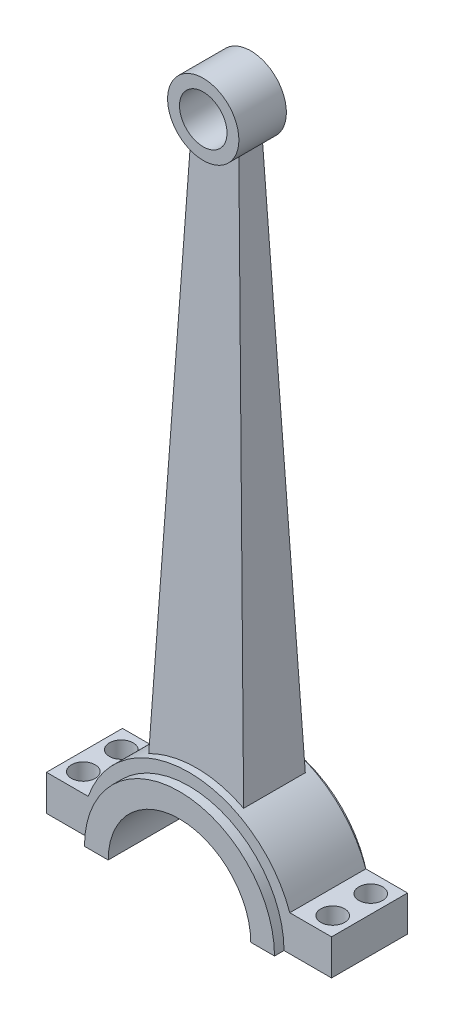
ISO-10303-21;
HEADER;
FILE_DESCRIPTION(('STEP AP214'),'2;1');
FILE_NAME('part.step','',(''),(''),'','','');
FILE_SCHEMA(('AUTOMOTIVE_DESIGN { 1 0 10303 214 1 1 1 1 }'));
ENDSEC;
DATA;
#1=APPLICATION_CONTEXT('core data for automotive mechanical design processes');
#2=APPLICATION_PROTOCOL_DEFINITION('international standard','automotive_design',2000,#1);
#3=PRODUCT_CONTEXT('',#1,'mechanical');
#4=PRODUCT('Part','Part','',(#3));
#5=PRODUCT_RELATED_PRODUCT_CATEGORY('part','',(#4));
#6=PRODUCT_DEFINITION_FORMATION('','',#4);
#7=PRODUCT_DEFINITION_CONTEXT('part definition',#1,'design');
#8=PRODUCT_DEFINITION('design','',#6,#7);
#9=PRODUCT_DEFINITION_SHAPE('','',#8);
#10=(LENGTH_UNIT() NAMED_UNIT(*) SI_UNIT(.MILLI.,.METRE.));
#11=(NAMED_UNIT(*) PLANE_ANGLE_UNIT() SI_UNIT($,.RADIAN.));
#12=(NAMED_UNIT(*) SI_UNIT($,.STERADIAN.) SOLID_ANGLE_UNIT());
#13=UNCERTAINTY_MEASURE_WITH_UNIT(LENGTH_MEASURE(1.E-05),#10,'distance_accuracy_value','');
#14=(GEOMETRIC_REPRESENTATION_CONTEXT(3) GLOBAL_UNCERTAINTY_ASSIGNED_CONTEXT((#13)) GLOBAL_UNIT_ASSIGNED_CONTEXT((#10,
#11,#12)) REPRESENTATION_CONTEXT('',''));
#15=CARTESIAN_POINT('',(0.,0.,0.));
#16=DIRECTION('',(0.,0.,1.));
#17=DIRECTION('',(1.,0.,0.));
#18=AXIS2_PLACEMENT_3D('',#15,#16,#17);
#19=CARTESIAN_POINT('',(0.,0.,16.));
#20=DIRECTION('',(0.,0.,1.));
#21=DIRECTION('',(1.,0.,0.));
#22=AXIS2_PLACEMENT_3D('',#19,#20,#21);
#23=PLANE('',#22);
#24=DIRECTION('',(1.,0.,0.));
#25=VECTOR('',#24,1.);
#26=CARTESIAN_POINT('',(0.,0.,16.));
#27=LINE('',#26,#25);
#28=CARTESIAN_POINT('',(-60.,0.,16.));
#29=VERTEX_POINT('',#28);
#30=CARTESIAN_POINT('',(-40.,0.,16.));
#31=VERTEX_POINT('',#30);
#32=EDGE_CURVE('E50',#29,#31,#27,.T.);
#33=ORIENTED_EDGE('',*,*,#32,.T.);
#34=CARTESIAN_POINT('',(0.,0.,16.));
#35=DIRECTION('',(0.,0.,1.));
#36=DIRECTION('',(1.,0.,0.));
#37=AXIS2_PLACEMENT_3D('',#34,#35,#36);
#38=CIRCLE('',#37,40.);
#39=CARTESIAN_POINT('',(40.,0.,16.));
#40=VERTEX_POINT('',#39);
#41=EDGE_CURVE('E54',#31,#40,#38,.F.);
#42=ORIENTED_EDGE('',*,*,#41,.T.);
#43=DIRECTION('',(1.,0.,0.));
#44=VECTOR('',#43,1.);
#45=CARTESIAN_POINT('',(0.,0.,16.));
#46=LINE('',#45,#44);
#47=CARTESIAN_POINT('',(60.,0.,16.));
#48=VERTEX_POINT('',#47);
#49=EDGE_CURVE('E240',#40,#48,#46,.T.);
#50=ORIENTED_EDGE('',*,*,#49,.T.);
#51=DIRECTION('',(0.,1.,0.));
#52=VECTOR('',#51,1.);
#53=CARTESIAN_POINT('',(60.,0.,16.));
#54=LINE('',#53,#52);
#55=CARTESIAN_POINT('',(60.,15.,16.));
#56=VERTEX_POINT('',#55);
#57=EDGE_CURVE('E242',#48,#56,#54,.T.);
#58=ORIENTED_EDGE('',*,*,#57,.T.);
#59=DIRECTION('',(1.,0.,0.));
#60=VECTOR('',#59,1.);
#61=CARTESIAN_POINT('',(0.,15.,16.));
#62=LINE('',#61,#60);
#63=CARTESIAN_POINT('',(42.4264068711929,15.,16.));
#64=VERTEX_POINT('',#63);
#65=EDGE_CURVE('E245',#64,#56,#62,.T.);
#66=ORIENTED_EDGE('',*,*,#65,.F.);
#67=CARTESIAN_POINT('',(0.,0.,16.));
#68=DIRECTION('',(0.,0.,1.));
#69=DIRECTION('',(1.,0.,0.));
#70=AXIS2_PLACEMENT_3D('',#67,#68,#69);
#71=CIRCLE('',#70,45.);
#72=CARTESIAN_POINT('',(-42.4264068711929,15.,16.));
#73=VERTEX_POINT('',#72);
#74=EDGE_CURVE('E248',#64,#73,#71,.T.);
#75=ORIENTED_EDGE('',*,*,#74,.T.);
#76=DIRECTION('',(1.,0.,0.));
#77=VECTOR('',#76,1.);
#78=CARTESIAN_POINT('',(0.,15.,16.));
#79=LINE('',#78,#77);
#80=CARTESIAN_POINT('',(-60.,15.,16.));
#81=VERTEX_POINT('',#80);
#82=EDGE_CURVE('E250',#81,#73,#79,.T.);
#83=ORIENTED_EDGE('',*,*,#82,.F.);
#84=DIRECTION('',(0.,1.,0.));
#85=VECTOR('',#84,1.);
#86=CARTESIAN_POINT('',(-60.,0.,16.));
#87=LINE('',#86,#85);
#88=EDGE_CURVE('E253',#29,#81,#87,.T.);
#89=ORIENTED_EDGE('',*,*,#88,.F.);
#90=EDGE_LOOP('',(#33,#42,#50,#58,#66,#75,#83,#89));
#91=FACE_BOUND('',#90,.T.);
#92=ADVANCED_FACE('F35',(#91),#23,.T.);
#93=CARTESIAN_POINT('',(0.,0.,-16.));
#94=DIRECTION('',(0.,0.,1.));
#95=DIRECTION('',(1.,0.,0.));
#96=AXIS2_PLACEMENT_3D('',#93,#94,#95);
#97=PLANE('',#96);
#98=CARTESIAN_POINT('',(0.,0.,-16.));
#99=DIRECTION('',(0.,0.,1.));
#100=DIRECTION('',(1.,0.,0.));
#101=AXIS2_PLACEMENT_3D('',#98,#99,#100);
#102=CIRCLE('',#101,40.);
#103=CARTESIAN_POINT('',(-40.,0.,-16.));
#104=VERTEX_POINT('',#103);
#105=CARTESIAN_POINT('',(40.,0.,-16.));
#106=VERTEX_POINT('',#105);
#107=EDGE_CURVE('E11',#104,#106,#102,.F.);
#108=ORIENTED_EDGE('',*,*,#107,.F.);
#109=DIRECTION('',(1.,0.,0.));
#110=VECTOR('',#109,1.);
#111=CARTESIAN_POINT('',(0.,0.,-16.));
#112=LINE('',#111,#110);
#113=CARTESIAN_POINT('',(-60.,0.,-16.));
#114=VERTEX_POINT('',#113);
#115=EDGE_CURVE('E243',#114,#104,#112,.T.);
#116=ORIENTED_EDGE('',*,*,#115,.F.);
#117=DIRECTION('',(0.,1.,0.));
#118=VECTOR('',#117,1.);
#119=CARTESIAN_POINT('',(-60.,0.,-16.));
#120=LINE('',#119,#118);
#121=CARTESIAN_POINT('',(-60.,15.,-16.));
#122=VERTEX_POINT('',#121);
#123=EDGE_CURVE('E271',#114,#122,#120,.T.);
#124=ORIENTED_EDGE('',*,*,#123,.T.);
#125=DIRECTION('',(1.,0.,0.));
#126=VECTOR('',#125,1.);
#127=CARTESIAN_POINT('',(0.,15.,-16.));
#128=LINE('',#127,#126);
#129=CARTESIAN_POINT('',(-42.4264068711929,15.,-16.));
#130=VERTEX_POINT('',#129);
#131=EDGE_CURVE('E268',#122,#130,#128,.T.);
#132=ORIENTED_EDGE('',*,*,#131,.T.);
#133=CARTESIAN_POINT('',(0.,0.,-16.));
#134=DIRECTION('',(0.,0.,1.));
#135=DIRECTION('',(1.,0.,0.));
#136=AXIS2_PLACEMENT_3D('',#133,#134,#135);
#137=CIRCLE('',#136,45.);
#138=CARTESIAN_POINT('',(42.4264068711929,15.,-16.));
#139=VERTEX_POINT('',#138);
#140=EDGE_CURVE('E265',#139,#130,#137,.T.);
#141=ORIENTED_EDGE('',*,*,#140,.F.);
#142=DIRECTION('',(1.,0.,0.));
#143=VECTOR('',#142,1.);
#144=CARTESIAN_POINT('',(0.,15.,-16.));
#145=LINE('',#144,#143);
#146=CARTESIAN_POINT('',(60.,15.,-16.));
#147=VERTEX_POINT('',#146);
#148=EDGE_CURVE('E262',#139,#147,#145,.T.);
#149=ORIENTED_EDGE('',*,*,#148,.T.);
#150=DIRECTION('',(0.,1.,0.));
#151=VECTOR('',#150,1.);
#152=CARTESIAN_POINT('',(60.,0.,-16.));
#153=LINE('',#152,#151);
#154=CARTESIAN_POINT('',(60.,0.,-16.));
#155=VERTEX_POINT('',#154);
#156=EDGE_CURVE('E259',#155,#147,#153,.T.);
#157=ORIENTED_EDGE('',*,*,#156,.F.);
#158=DIRECTION('',(1.,0.,0.));
#159=VECTOR('',#158,1.);
#160=CARTESIAN_POINT('',(0.,0.,-16.));
#161=LINE('',#160,#159);
#162=EDGE_CURVE('E239',#106,#155,#161,.T.);
#163=ORIENTED_EDGE('',*,*,#162,.F.);
#164=EDGE_LOOP('',(#108,#116,#124,#132,#141,#149,#157,#163));
#165=FACE_BOUND('',#164,.T.);
#166=ADVANCED_FACE('F338',(#165),#97,.F.);
#167=CARTESIAN_POINT('',(0.,0.,16.));
#168=DIRECTION('',(0.,0.,-1.));
#169=DIRECTION('',(-1.,0.,0.));
#170=AXIS2_PLACEMENT_3D('',#167,#168,#169);
#171=CYLINDRICAL_SURFACE('',#170,30.);
#172=DIRECTION('',(0.,0.,-1.));
#173=VECTOR('',#172,1.);
#174=CARTESIAN_POINT('',(-30.,0.,16.));
#175=LINE('',#174,#173);
#176=CARTESIAN_POINT('',(-30.,0.,20.));
#177=VERTEX_POINT('',#176);
#178=CARTESIAN_POINT('',(-30.,0.,-20.));
#179=VERTEX_POINT('',#178);
#180=EDGE_CURVE('E257',#177,#179,#175,.T.);
#181=ORIENTED_EDGE('',*,*,#180,.T.);
#182=CARTESIAN_POINT('',(0.,0.,-20.));
#183=DIRECTION('',(0.,0.,-1.));
#184=DIRECTION('',(1.,0.,0.));
#185=AXIS2_PLACEMENT_3D('',#182,#183,#184);
#186=CIRCLE('',#185,30.);
#187=CARTESIAN_POINT('',(30.,0.,-20.));
#188=VERTEX_POINT('',#187);
#189=EDGE_CURVE('E151',#179,#188,#186,.T.);
#190=ORIENTED_EDGE('',*,*,#189,.T.);
#191=DIRECTION('',(0.,0.,-1.));
#192=VECTOR('',#191,1.);
#193=CARTESIAN_POINT('',(30.,0.,16.));
#194=LINE('',#193,#192);
#195=CARTESIAN_POINT('',(30.,0.,20.));
#196=VERTEX_POINT('',#195);
#197=EDGE_CURVE('E43',#196,#188,#194,.T.);
#198=ORIENTED_EDGE('',*,*,#197,.F.);
#199=CARTESIAN_POINT('',(0.,0.,20.));
#200=DIRECTION('',(0.,0.,-1.));
#201=DIRECTION('',(1.,0.,0.));
#202=AXIS2_PLACEMENT_3D('',#199,#200,#201);
#203=CIRCLE('',#202,30.);
#204=EDGE_CURVE('E149',#177,#196,#203,.T.);
#205=ORIENTED_EDGE('',*,*,#204,.F.);
#206=EDGE_LOOP('',(#181,#190,#198,#205));
#207=FACE_BOUND('',#206,.T.);
#208=ADVANCED_FACE('F147',(#207),#171,.F.);
#209=CARTESIAN_POINT('',(0.,0.,16.));
#210=DIRECTION('',(0.,1.,0.));
#211=DIRECTION('',(0.,0.,1.));
#212=AXIS2_PLACEMENT_3D('',#209,#210,#211);
#213=PLANE('',#212);
#214=ORIENTED_EDGE('',*,*,#197,.T.);
#215=DIRECTION('',(1.,0.,0.));
#216=VECTOR('',#215,1.);
#217=CARTESIAN_POINT('',(30.,0.,-20.));
#218=LINE('',#217,#216);
#219=CARTESIAN_POINT('',(40.,0.,-20.));
#220=VERTEX_POINT('',#219);
#221=EDGE_CURVE('E181',#188,#220,#218,.T.);
#222=ORIENTED_EDGE('',*,*,#221,.T.);
#223=DIRECTION('',(0.,0.,-1.));
#224=VECTOR('',#223,1.);
#225=CARTESIAN_POINT('',(40.,0.,20.));
#226=LINE('',#225,#224);
#227=EDGE_CURVE('E188',#106,#220,#226,.T.);
#228=ORIENTED_EDGE('',*,*,#227,.F.);
#229=ORIENTED_EDGE('',*,*,#162,.T.);
#230=DIRECTION('',(0.,0.,-1.));
#231=VECTOR('',#230,1.);
#232=CARTESIAN_POINT('',(60.,0.,16.));
#233=LINE('',#232,#231);
#234=EDGE_CURVE('E155',#48,#155,#233,.T.);
#235=ORIENTED_EDGE('',*,*,#234,.F.);
#236=ORIENTED_EDGE('',*,*,#49,.F.);
#237=CARTESIAN_POINT('',(40.,0.,20.));
#238=VERTEX_POINT('',#237);
#239=EDGE_CURVE('E162',#238,#40,#226,.T.);
#240=ORIENTED_EDGE('',*,*,#239,.F.);
#241=DIRECTION('',(1.,0.,0.));
#242=VECTOR('',#241,1.);
#243=CARTESIAN_POINT('',(30.,0.,20.));
#244=LINE('',#243,#242);
#245=EDGE_CURVE('E158',#196,#238,#244,.T.);
#246=ORIENTED_EDGE('',*,*,#245,.F.);
#247=EDGE_LOOP('',(#214,#222,#228,#229,#235,#236,#240,#246));
#248=FACE_BOUND('',#247,.T.);
#249=CARTESIAN_POINT('',(52.5,0.,-8.00000000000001));
#250=DIRECTION('',(0.,1.,0.));
#251=DIRECTION('',(0.,0.,-1.));
#252=AXIS2_PLACEMENT_3D('',#249,#250,#251);
#253=CIRCLE('',#252,5.);
#254=CARTESIAN_POINT('',(52.5,0.,-13.));
#255=VERTEX_POINT('',#254);
#256=EDGE_CURVE('E191',#255,#255,#253,.T.);
#257=ORIENTED_EDGE('',*,*,#256,.T.);
#258=EDGE_LOOP('',(#257));
#259=FACE_BOUND('',#258,.T.);
#260=CARTESIAN_POINT('',(52.5,0.,7.99999999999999));
#261=DIRECTION('',(0.,1.,0.));
#262=DIRECTION('',(0.,0.,-1.));
#263=AXIS2_PLACEMENT_3D('',#260,#261,#262);
#264=CIRCLE('',#263,5.);
#265=CARTESIAN_POINT('',(52.5,0.,3.));
#266=VERTEX_POINT('',#265);
#267=EDGE_CURVE('E192',#266,#266,#264,.T.);
#268=ORIENTED_EDGE('',*,*,#267,.T.);
#269=EDGE_LOOP('',(#268));
#270=FACE_BOUND('',#269,.T.);
#271=ADVANCED_FACE('F159',(#248,#259,#270),#213,.F.);
#272=CARTESIAN_POINT('',(60.,0.,16.));
#273=DIRECTION('',(-1.,0.,0.));
#274=DIRECTION('',(0.,0.,1.));
#275=AXIS2_PLACEMENT_3D('',#272,#273,#274);
#276=PLANE('',#275);
#277=ORIENTED_EDGE('',*,*,#156,.T.);
#278=DIRECTION('',(0.,0.,-1.));
#279=VECTOR('',#278,1.);
#280=CARTESIAN_POINT('',(60.,15.,16.));
#281=LINE('',#280,#279);
#282=EDGE_CURVE('E285',#56,#147,#281,.T.);
#283=ORIENTED_EDGE('',*,*,#282,.F.);
#284=ORIENTED_EDGE('',*,*,#57,.F.);
#285=ORIENTED_EDGE('',*,*,#234,.T.);
#286=EDGE_LOOP('',(#277,#283,#284,#285));
#287=FACE_BOUND('',#286,.T.);
#288=ADVANCED_FACE('F362',(#287),#276,.F.);
#289=CARTESIAN_POINT('',(0.,15.,16.));
#290=DIRECTION('',(0.,1.,0.));
#291=DIRECTION('',(0.,0.,1.));
#292=AXIS2_PLACEMENT_3D('',#289,#290,#291);
#293=PLANE('',#292);
#294=CARTESIAN_POINT('',(52.5,15.,7.99999999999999));
#295=DIRECTION('',(0.,1.,0.));
#296=DIRECTION('',(0.,0.,1.));
#297=AXIS2_PLACEMENT_3D('',#294,#295,#296);
#298=CIRCLE('',#297,5.);
#299=CARTESIAN_POINT('',(52.5,15.,13.));
#300=VERTEX_POINT('',#299);
#301=EDGE_CURVE('E195',#300,#300,#298,.T.);
#302=ORIENTED_EDGE('',*,*,#301,.F.);
#303=EDGE_LOOP('',(#302));
#304=FACE_BOUND('',#303,.T.);
#305=CARTESIAN_POINT('',(52.5,15.,-8.00000000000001));
#306=DIRECTION('',(0.,1.,0.));
#307=DIRECTION('',(0.,0.,1.));
#308=AXIS2_PLACEMENT_3D('',#305,#306,#307);
#309=CIRCLE('',#308,5.);
#310=CARTESIAN_POINT('',(52.5,15.,-3.00000000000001));
#311=VERTEX_POINT('',#310);
#312=EDGE_CURVE('E196',#311,#311,#309,.T.);
#313=ORIENTED_EDGE('',*,*,#312,.F.);
#314=EDGE_LOOP('',(#313));
#315=FACE_BOUND('',#314,.T.);
#316=ORIENTED_EDGE('',*,*,#148,.F.);
#317=DIRECTION('',(0.,0.,-1.));
#318=VECTOR('',#317,1.);
#319=CARTESIAN_POINT('',(42.4264068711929,15.,16.));
#320=LINE('',#319,#318);
#321=EDGE_CURVE('E283',#64,#139,#320,.T.);
#322=ORIENTED_EDGE('',*,*,#321,.F.);
#323=ORIENTED_EDGE('',*,*,#65,.T.);
#324=ORIENTED_EDGE('',*,*,#282,.T.);
#325=EDGE_LOOP('',(#316,#322,#323,#324));
#326=FACE_BOUND('',#325,.T.);
#327=ADVANCED_FACE('F359',(#304,#315,#326),#293,.T.);
#328=CARTESIAN_POINT('',(0.,0.,16.));
#329=DIRECTION('',(0.,0.,-1.));
#330=DIRECTION('',(-1.,0.,0.));
#331=AXIS2_PLACEMENT_3D('',#328,#329,#330);
#332=CYLINDRICAL_SURFACE('',#331,45.);
#333=DIRECTION('',(0.,0.,-1.));
#334=VECTOR('',#333,1.);
#335=CARTESIAN_POINT('',(19.9763796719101,40.3229990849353,5.));
#336=LINE('',#335,#334);
#337=CARTESIAN_POINT('',(19.9763796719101,40.3229990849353,12.9792792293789));
#338=VERTEX_POINT('',#337);
#339=CARTESIAN_POINT('',(19.9763796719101,40.3229990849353,-12.9792792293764));
#340=VERTEX_POINT('',#339);
#341=EDGE_CURVE('E236',#338,#340,#336,.T.);
#342=ORIENTED_EDGE('',*,*,#341,.F.);
#343=CARTESIAN_POINT('',(0.,0.,14.3873893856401));
#344=DIRECTION('',(0.,0.0348994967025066,0.999390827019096));
#345=DIRECTION('',(0.,0.999390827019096,-0.0348994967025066));
#346=AXIS2_PLACEMENT_3D('',#343,#344,#345);
#347=ELLIPSE('',#346,45.027429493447,45.);
#348=CARTESIAN_POINT('',(-19.9763796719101,40.3229990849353,12.9792792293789));
#349=VERTEX_POINT('',#348);
#350=EDGE_CURVE('E300',#338,#349,#347,.T.);
#351=ORIENTED_EDGE('',*,*,#350,.T.);
#352=DIRECTION('',(0.,0.,-1.));
#353=VECTOR('',#352,1.);
#354=CARTESIAN_POINT('',(-19.9763796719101,40.3229990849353,5.));
#355=LINE('',#354,#353);
#356=CARTESIAN_POINT('',(-19.9763796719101,40.3229990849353,-12.9792792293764));
#357=VERTEX_POINT('',#356);
#358=EDGE_CURVE('E228',#349,#357,#355,.T.);
#359=ORIENTED_EDGE('',*,*,#358,.T.);
#360=CARTESIAN_POINT('',(0.,0.,-14.3873893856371));
#361=DIRECTION('',(0.,0.0348994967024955,-0.999390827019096));
#362=DIRECTION('',(0.,-0.999390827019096,-0.0348994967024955));
#363=AXIS2_PLACEMENT_3D('',#360,#361,#362);
#364=ELLIPSE('',#363,45.027429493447,45.);
#365=EDGE_CURVE('E223',#340,#357,#364,.F.);
#366=ORIENTED_EDGE('',*,*,#365,.F.);
#367=EDGE_LOOP('',(#342,#351,#359,#366));
#368=FACE_BOUND('',#367,.T.);
#369=ORIENTED_EDGE('',*,*,#140,.T.);
#370=DIRECTION('',(0.,0.,-1.));
#371=VECTOR('',#370,1.);
#372=CARTESIAN_POINT('',(-42.4264068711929,15.,16.));
#373=LINE('',#372,#371);
#374=EDGE_CURVE('E281',#73,#130,#373,.T.);
#375=ORIENTED_EDGE('',*,*,#374,.F.);
#376=ORIENTED_EDGE('',*,*,#74,.F.);
#377=ORIENTED_EDGE('',*,*,#321,.T.);
#378=EDGE_LOOP('',(#369,#375,#376,#377));
#379=FACE_BOUND('',#378,.T.);
#380=ADVANCED_FACE('F318',(#368,#379),#332,.T.);
#381=CARTESIAN_POINT('',(0.,15.,16.));
#382=DIRECTION('',(0.,1.,0.));
#383=DIRECTION('',(0.,0.,1.));
#384=AXIS2_PLACEMENT_3D('',#381,#382,#383);
#385=PLANE('',#384);
#386=CARTESIAN_POINT('',(-52.5,15.,7.99999999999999));
#387=DIRECTION('',(0.,1.,0.));
#388=DIRECTION('',(0.,0.,1.));
#389=AXIS2_PLACEMENT_3D('',#386,#387,#388);
#390=CIRCLE('',#389,5.);
#391=CARTESIAN_POINT('',(-52.5,15.,13.));
#392=VERTEX_POINT('',#391);
#393=EDGE_CURVE('E208',#392,#392,#390,.F.);
#394=ORIENTED_EDGE('',*,*,#393,.T.);
#395=EDGE_LOOP('',(#394));
#396=FACE_BOUND('',#395,.T.);
#397=CARTESIAN_POINT('',(-52.5,15.,-8.00000000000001));
#398=DIRECTION('',(0.,1.,0.));
#399=DIRECTION('',(0.,0.,1.));
#400=AXIS2_PLACEMENT_3D('',#397,#398,#399);
#401=CIRCLE('',#400,5.);
#402=CARTESIAN_POINT('',(-52.5,15.,-3.00000000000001));
#403=VERTEX_POINT('',#402);
#404=EDGE_CURVE('E199',#403,#403,#401,.F.);
#405=ORIENTED_EDGE('',*,*,#404,.T.);
#406=EDGE_LOOP('',(#405));
#407=FACE_BOUND('',#406,.T.);
#408=ORIENTED_EDGE('',*,*,#131,.F.);
#409=DIRECTION('',(0.,0.,-1.));
#410=VECTOR('',#409,1.);
#411=CARTESIAN_POINT('',(-60.,15.,16.));
#412=LINE('',#411,#410);
#413=EDGE_CURVE('E279',#81,#122,#412,.T.);
#414=ORIENTED_EDGE('',*,*,#413,.F.);
#415=ORIENTED_EDGE('',*,*,#82,.T.);
#416=ORIENTED_EDGE('',*,*,#374,.T.);
#417=EDGE_LOOP('',(#408,#414,#415,#416));
#418=FACE_BOUND('',#417,.T.);
#419=ADVANCED_FACE('F352',(#396,#407,#418),#385,.T.);
#420=CARTESIAN_POINT('',(-60.,0.,16.));
#421=DIRECTION('',(-1.,0.,0.));
#422=DIRECTION('',(0.,0.,1.));
#423=AXIS2_PLACEMENT_3D('',#420,#421,#422);
#424=PLANE('',#423);
#425=ORIENTED_EDGE('',*,*,#123,.F.);
#426=DIRECTION('',(0.,0.,-1.));
#427=VECTOR('',#426,1.);
#428=CARTESIAN_POINT('',(-60.,0.,16.));
#429=LINE('',#428,#427);
#430=EDGE_CURVE('E277',#29,#114,#429,.T.);
#431=ORIENTED_EDGE('',*,*,#430,.F.);
#432=ORIENTED_EDGE('',*,*,#88,.T.);
#433=ORIENTED_EDGE('',*,*,#413,.T.);
#434=EDGE_LOOP('',(#425,#431,#432,#433));
#435=FACE_BOUND('',#434,.T.);
#436=ADVANCED_FACE('F348',(#435),#424,.T.);
#437=CARTESIAN_POINT('',(0.,0.,16.));
#438=DIRECTION('',(0.,1.,0.));
#439=DIRECTION('',(0.,0.,1.));
#440=AXIS2_PLACEMENT_3D('',#437,#438,#439);
#441=PLANE('',#440);
#442=ORIENTED_EDGE('',*,*,#180,.F.);
#443=DIRECTION('',(1.,0.,0.));
#444=VECTOR('',#443,1.);
#445=CARTESIAN_POINT('',(-40.,0.,20.));
#446=LINE('',#445,#444);
#447=CARTESIAN_POINT('',(-40.,0.,20.));
#448=VERTEX_POINT('',#447);
#449=EDGE_CURVE('E170',#448,#177,#446,.T.);
#450=ORIENTED_EDGE('',*,*,#449,.F.);
#451=DIRECTION('',(0.,0.,-1.));
#452=VECTOR('',#451,1.);
#453=CARTESIAN_POINT('',(-40.,0.,20.));
#454=LINE('',#453,#452);
#455=EDGE_CURVE('E185',#448,#31,#454,.T.);
#456=ORIENTED_EDGE('',*,*,#455,.T.);
#457=ORIENTED_EDGE('',*,*,#32,.F.);
#458=ORIENTED_EDGE('',*,*,#430,.T.);
#459=ORIENTED_EDGE('',*,*,#115,.T.);
#460=CARTESIAN_POINT('',(-40.,0.,-20.));
#461=VERTEX_POINT('',#460);
#462=EDGE_CURVE('E179',#104,#461,#454,.T.);
#463=ORIENTED_EDGE('',*,*,#462,.T.);
#464=DIRECTION('',(1.,0.,0.));
#465=VECTOR('',#464,1.);
#466=CARTESIAN_POINT('',(-40.,0.,-20.));
#467=LINE('',#466,#465);
#468=EDGE_CURVE('E171',#461,#179,#467,.T.);
#469=ORIENTED_EDGE('',*,*,#468,.T.);
#470=EDGE_LOOP('',(#442,#450,#456,#457,#458,#459,#463,#469));
#471=FACE_BOUND('',#470,.T.);
#472=CARTESIAN_POINT('',(-52.5,0.,-8.00000000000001));
#473=DIRECTION('',(0.,-1.,0.));
#474=DIRECTION('',(0.,0.,-1.));
#475=AXIS2_PLACEMENT_3D('',#472,#473,#474);
#476=CIRCLE('',#475,5.);
#477=CARTESIAN_POINT('',(-52.5,0.,-13.));
#478=VERTEX_POINT('',#477);
#479=EDGE_CURVE('E211',#478,#478,#476,.T.);
#480=ORIENTED_EDGE('',*,*,#479,.F.);
#481=EDGE_LOOP('',(#480));
#482=FACE_BOUND('',#481,.T.);
#483=CARTESIAN_POINT('',(-52.5,0.,7.99999999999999));
#484=DIRECTION('',(0.,-1.,0.));
#485=DIRECTION('',(0.,0.,-1.));
#486=AXIS2_PLACEMENT_3D('',#483,#484,#485);
#487=CIRCLE('',#486,5.);
#488=CARTESIAN_POINT('',(-52.5,0.,3.));
#489=VERTEX_POINT('',#488);
#490=EDGE_CURVE('E204',#489,#489,#487,.T.);
#491=ORIENTED_EDGE('',*,*,#490,.F.);
#492=EDGE_LOOP('',(#491));
#493=FACE_BOUND('',#492,.T.);
#494=ADVANCED_FACE('F334',(#471,#482,#493),#441,.F.);
#495=CARTESIAN_POINT('',(21.6955620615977,0.947248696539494,5.));
#496=DIRECTION('',(0.999048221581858,0.0436193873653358,0.));
#497=DIRECTION('',(-0.0436193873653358,0.999048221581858,0.));
#498=AXIS2_PLACEMENT_3D('',#495,#496,#497);
#499=PLANE('',#498);
#500=DIRECTION('',(-0.0435928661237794,0.998440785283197,0.0348663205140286));
#501=VECTOR('',#500,1.);
#502=CARTESIAN_POINT('',(21.6661450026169,1.62101011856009,-14.3307824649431));
#503=LINE('',#502,#501);
#504=CARTESIAN_POINT('',(10.,268.819660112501,-5.));
#505=VERTEX_POINT('',#504);
#506=EDGE_CURVE('E291',#505,#340,#503,.F.);
#507=ORIENTED_EDGE('',*,*,#506,.F.);
#508=DIRECTION('',(0.,0.,-1.));
#509=VECTOR('',#508,1.);
#510=CARTESIAN_POINT('',(10.,268.819660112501,5.));
#511=LINE('',#510,#509);
#512=CARTESIAN_POINT('',(10.,268.819660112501,5.));
#513=VERTEX_POINT('',#512);
#514=EDGE_CURVE('E234',#513,#505,#511,.T.);
#515=ORIENTED_EDGE('',*,*,#514,.F.);
#516=DIRECTION('',(0.0435928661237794,-0.998440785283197,0.0348663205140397));
#517=VECTOR('',#516,1.);
#518=CARTESIAN_POINT('',(21.6813442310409,1.27289055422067,14.342939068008));
#519=LINE('',#518,#517);
#520=EDGE_CURVE('E302',#513,#338,#519,.T.);
#521=ORIENTED_EDGE('',*,*,#520,.T.);
#522=ORIENTED_EDGE('',*,*,#341,.T.);
#523=EDGE_LOOP('',(#507,#515,#521,#522));
#524=FACE_BOUND('',#523,.T.);
#525=ADVANCED_FACE('F311',(#524),#499,.T.);
#526=CARTESIAN_POINT('',(-21.6955620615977,0.947248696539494,5.));
#527=DIRECTION('',(0.999048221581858,-0.0436193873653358,0.));
#528=DIRECTION('',(0.0436193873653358,0.999048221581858,0.));
#529=AXIS2_PLACEMENT_3D('',#526,#527,#528);
#530=PLANE('',#529);
#531=DIRECTION('',(0.0435928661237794,0.998440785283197,0.0348663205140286));
#532=VECTOR('',#531,1.);
#533=CARTESIAN_POINT('',(-21.6661450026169,1.62101011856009,-14.3307824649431));
#534=LINE('',#533,#532);
#535=CARTESIAN_POINT('',(-10.,268.819660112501,-5.));
#536=VERTEX_POINT('',#535);
#537=EDGE_CURVE('E297',#536,#357,#534,.F.);
#538=ORIENTED_EDGE('',*,*,#537,.T.);
#539=ORIENTED_EDGE('',*,*,#358,.F.);
#540=DIRECTION('',(-0.0435928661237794,-0.998440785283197,0.0348663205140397));
#541=VECTOR('',#540,1.);
#542=CARTESIAN_POINT('',(-21.6813442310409,1.27289055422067,14.342939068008));
#543=LINE('',#542,#541);
#544=CARTESIAN_POINT('',(-10.,268.819660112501,5.));
#545=VERTEX_POINT('',#544);
#546=EDGE_CURVE('E231',#545,#349,#543,.T.);
#547=ORIENTED_EDGE('',*,*,#546,.F.);
#548=DIRECTION('',(0.,0.,-1.));
#549=VECTOR('',#548,1.);
#550=CARTESIAN_POINT('',(-10.,268.819660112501,5.));
#551=LINE('',#550,#549);
#552=EDGE_CURVE('E230',#545,#536,#551,.T.);
#553=ORIENTED_EDGE('',*,*,#552,.T.);
#554=EDGE_LOOP('',(#538,#539,#547,#553));
#555=FACE_BOUND('',#554,.T.);
#556=ADVANCED_FACE('F327',(#555),#530,.F.);
#557=CARTESIAN_POINT('',(0.,268.819660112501,5.));
#558=DIRECTION('',(0.,0.0348994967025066,0.999390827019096));
#559=DIRECTION('',(0.,-0.999390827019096,0.0348994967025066));
#560=AXIS2_PLACEMENT_3D('',#557,#558,#559);
#561=PLANE('',#560);
#562=ORIENTED_EDGE('',*,*,#350,.F.);
#563=ORIENTED_EDGE('',*,*,#520,.F.);
#564=CARTESIAN_POINT('',(0.,280.,4.60957392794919));
#565=DIRECTION('',(0.,0.0348994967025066,0.999390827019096));
#566=DIRECTION('',(0.,0.999390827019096,-0.0348994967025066));
#567=AXIS2_PLACEMENT_3D('',#564,#565,#566);
#568=ELLIPSE('',#567,15.0091431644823,15.);
#569=EDGE_CURVE('E305',#545,#513,#568,.T.);
#570=ORIENTED_EDGE('',*,*,#569,.F.);
#571=ORIENTED_EDGE('',*,*,#546,.T.);
#572=EDGE_LOOP('',(#562,#563,#570,#571));
#573=FACE_BOUND('',#572,.T.);
#574=ADVANCED_FACE('F37',(#573),#561,.T.);
#575=CARTESIAN_POINT('',(0.,268.819660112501,-5.));
#576=DIRECTION('',(0.,0.0348994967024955,-0.999390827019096));
#577=DIRECTION('',(0.,0.999390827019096,0.0348994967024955));
#578=AXIS2_PLACEMENT_3D('',#575,#576,#577);
#579=PLANE('',#578);
#580=ORIENTED_EDGE('',*,*,#365,.T.);
#581=ORIENTED_EDGE('',*,*,#537,.F.);
#582=CARTESIAN_POINT('',(0.,280.,-4.60957392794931));
#583=DIRECTION('',(0.,0.0348994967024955,-0.999390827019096));
#584=DIRECTION('',(0.,-0.999390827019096,-0.0348994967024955));
#585=AXIS2_PLACEMENT_3D('',#582,#583,#584);
#586=ELLIPSE('',#585,15.0091431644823,15.);
#587=EDGE_CURVE('E294',#536,#505,#586,.F.);
#588=ORIENTED_EDGE('',*,*,#587,.T.);
#589=ORIENTED_EDGE('',*,*,#506,.T.);
#590=EDGE_LOOP('',(#580,#581,#588,#589));
#591=FACE_BOUND('',#590,.T.);
#592=ADVANCED_FACE('F322',(#591),#579,.T.);
#593=CARTESIAN_POINT('',(0.,280.,10.));
#594=DIRECTION('',(0.,0.,-1.));
#595=DIRECTION('',(-1.,0.,0.));
#596=AXIS2_PLACEMENT_3D('',#593,#594,#595);
#597=CYLINDRICAL_SURFACE('',#596,10.);
#598=CARTESIAN_POINT('',(0.,280.,10.));
#599=DIRECTION('',(0.,0.,1.));
#600=DIRECTION('',(1.,0.,0.));
#601=AXIS2_PLACEMENT_3D('',#598,#599,#600);
#602=CIRCLE('',#601,10.);
#603=CARTESIAN_POINT('',(10.,280.,10.));
#604=VERTEX_POINT('',#603);
#605=EDGE_CURVE('E216',#604,#604,#602,.T.);
#606=ORIENTED_EDGE('',*,*,#605,.T.);
#607=EDGE_LOOP('',(#606));
#608=FACE_BOUND('',#607,.T.);
#609=CARTESIAN_POINT('',(0.,280.,-10.));
#610=DIRECTION('',(0.,0.,1.));
#611=DIRECTION('',(1.,0.,0.));
#612=AXIS2_PLACEMENT_3D('',#609,#610,#611);
#613=CIRCLE('',#612,10.);
#614=CARTESIAN_POINT('',(10.,280.,-10.));
#615=VERTEX_POINT('',#614);
#616=EDGE_CURVE('E207',#615,#615,#613,.T.);
#617=ORIENTED_EDGE('',*,*,#616,.F.);
#618=EDGE_LOOP('',(#617));
#619=FACE_BOUND('',#618,.T.);
#620=ADVANCED_FACE('F371',(#608,#619),#597,.F.);
#621=CARTESIAN_POINT('',(0.,280.,10.));
#622=DIRECTION('',(0.,0.,-1.));
#623=DIRECTION('',(-1.,0.,0.));
#624=AXIS2_PLACEMENT_3D('',#621,#622,#623);
#625=CYLINDRICAL_SURFACE('',#624,15.);
#626=ORIENTED_EDGE('',*,*,#569,.T.);
#627=ORIENTED_EDGE('',*,*,#514,.T.);
#628=ORIENTED_EDGE('',*,*,#587,.F.);
#629=ORIENTED_EDGE('',*,*,#552,.F.);
#630=EDGE_LOOP('',(#626,#627,#628,#629));
#631=FACE_BOUND('',#630,.T.);
#632=CARTESIAN_POINT('',(0.,280.,10.));
#633=DIRECTION('',(0.,0.,1.));
#634=DIRECTION('',(1.,0.,0.));
#635=AXIS2_PLACEMENT_3D('',#632,#633,#634);
#636=CIRCLE('',#635,15.);
#637=CARTESIAN_POINT('',(15.,280.,10.));
#638=VERTEX_POINT('',#637);
#639=EDGE_CURVE('E219',#638,#638,#636,.T.);
#640=ORIENTED_EDGE('',*,*,#639,.F.);
#641=EDGE_LOOP('',(#640));
#642=FACE_BOUND('',#641,.T.);
#643=CARTESIAN_POINT('',(0.,280.,-10.));
#644=DIRECTION('',(0.,0.,1.));
#645=DIRECTION('',(1.,0.,0.));
#646=AXIS2_PLACEMENT_3D('',#643,#644,#645);
#647=CIRCLE('',#646,15.);
#648=CARTESIAN_POINT('',(15.,280.,-10.));
#649=VERTEX_POINT('',#648);
#650=EDGE_CURVE('E220',#649,#649,#647,.T.);
#651=ORIENTED_EDGE('',*,*,#650,.T.);
#652=EDGE_LOOP('',(#651));
#653=FACE_BOUND('',#652,.T.);
#654=ADVANCED_FACE('F324',(#631,#642,#653),#625,.T.);
#655=CARTESIAN_POINT('',(0.,0.,10.));
#656=DIRECTION('',(0.,0.,1.));
#657=DIRECTION('',(1.,0.,0.));
#658=AXIS2_PLACEMENT_3D('',#655,#656,#657);
#659=PLANE('',#658);
#660=ORIENTED_EDGE('',*,*,#605,.F.);
#661=EDGE_LOOP('',(#660));
#662=FACE_BOUND('',#661,.T.);
#663=ORIENTED_EDGE('',*,*,#639,.T.);
#664=EDGE_LOOP('',(#663));
#665=FACE_BOUND('',#664,.T.);
#666=ADVANCED_FACE('F379',(#662,#665),#659,.T.);
#667=CARTESIAN_POINT('',(0.,0.,-10.));
#668=DIRECTION('',(0.,0.,1.));
#669=DIRECTION('',(1.,0.,0.));
#670=AXIS2_PLACEMENT_3D('',#667,#668,#669);
#671=PLANE('',#670);
#672=ORIENTED_EDGE('',*,*,#616,.T.);
#673=EDGE_LOOP('',(#672));
#674=FACE_BOUND('',#673,.T.);
#675=ORIENTED_EDGE('',*,*,#650,.F.);
#676=EDGE_LOOP('',(#675));
#677=FACE_BOUND('',#676,.T.);
#678=ADVANCED_FACE('F383',(#674,#677),#671,.F.);
#679=CARTESIAN_POINT('',(-52.5,295.001,-8.00000000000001));
#680=DIRECTION('',(0.,-1.,0.));
#681=DIRECTION('',(0.,0.,-1.));
#682=AXIS2_PLACEMENT_3D('',#679,#680,#681);
#683=CYLINDRICAL_SURFACE('',#682,5.);
#684=ORIENTED_EDGE('',*,*,#404,.F.);
#685=EDGE_LOOP('',(#684));
#686=FACE_BOUND('',#685,.T.);
#687=ORIENTED_EDGE('',*,*,#479,.T.);
#688=EDGE_LOOP('',(#687));
#689=FACE_BOUND('',#688,.T.);
#690=ADVANCED_FACE('F386',(#686,#689),#683,.F.);
#691=CARTESIAN_POINT('',(-52.5,295.001,7.99999999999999));
#692=DIRECTION('',(0.,-1.,0.));
#693=DIRECTION('',(0.,0.,-1.));
#694=AXIS2_PLACEMENT_3D('',#691,#692,#693);
#695=CYLINDRICAL_SURFACE('',#694,5.);
#696=ORIENTED_EDGE('',*,*,#393,.F.);
#697=EDGE_LOOP('',(#696));
#698=FACE_BOUND('',#697,.T.);
#699=ORIENTED_EDGE('',*,*,#490,.T.);
#700=EDGE_LOOP('',(#699));
#701=FACE_BOUND('',#700,.T.);
#702=ADVANCED_FACE('F393',(#698,#701),#695,.F.);
#703=CARTESIAN_POINT('',(52.5,295.001,-8.00000000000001));
#704=DIRECTION('',(0.,-1.,0.));
#705=DIRECTION('',(0.,0.,-1.));
#706=AXIS2_PLACEMENT_3D('',#703,#704,#705);
#707=CYLINDRICAL_SURFACE('',#706,5.);
#708=ORIENTED_EDGE('',*,*,#312,.T.);
#709=EDGE_LOOP('',(#708));
#710=FACE_BOUND('',#709,.T.);
#711=ORIENTED_EDGE('',*,*,#256,.F.);
#712=EDGE_LOOP('',(#711));
#713=FACE_BOUND('',#712,.T.);
#714=ADVANCED_FACE('F397',(#710,#713),#707,.F.);
#715=CARTESIAN_POINT('',(52.5,295.001,7.99999999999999));
#716=DIRECTION('',(0.,-1.,0.));
#717=DIRECTION('',(0.,0.,-1.));
#718=AXIS2_PLACEMENT_3D('',#715,#716,#717);
#719=CYLINDRICAL_SURFACE('',#718,5.);
#720=ORIENTED_EDGE('',*,*,#301,.T.);
#721=EDGE_LOOP('',(#720));
#722=FACE_BOUND('',#721,.T.);
#723=ORIENTED_EDGE('',*,*,#267,.F.);
#724=EDGE_LOOP('',(#723));
#725=FACE_BOUND('',#724,.T.);
#726=ADVANCED_FACE('F401',(#722,#725),#719,.F.);
#727=CARTESIAN_POINT('',(0.,0.,-20.));
#728=DIRECTION('',(0.,0.,1.));
#729=DIRECTION('',(1.,0.,0.));
#730=AXIS2_PLACEMENT_3D('',#727,#728,#729);
#731=PLANE('',#730);
#732=ORIENTED_EDGE('',*,*,#189,.F.);
#733=ORIENTED_EDGE('',*,*,#468,.F.);
#734=CARTESIAN_POINT('',(0.,0.,-20.));
#735=DIRECTION('',(0.,0.,1.));
#736=DIRECTION('',(1.,0.,0.));
#737=AXIS2_PLACEMENT_3D('',#734,#735,#736);
#738=CIRCLE('',#737,40.);
#739=EDGE_CURVE('E174',#220,#461,#738,.T.);
#740=ORIENTED_EDGE('',*,*,#739,.F.);
#741=ORIENTED_EDGE('',*,*,#221,.F.);
#742=EDGE_LOOP('',(#732,#733,#740,#741));
#743=FACE_BOUND('',#742,.T.);
#744=ADVANCED_FACE('F405',(#743),#731,.F.);
#745=CARTESIAN_POINT('',(0.,0.,20.));
#746=DIRECTION('',(0.,0.,-1.));
#747=DIRECTION('',(-1.,0.,0.));
#748=AXIS2_PLACEMENT_3D('',#745,#746,#747);
#749=CYLINDRICAL_SURFACE('',#748,40.);
#750=ORIENTED_EDGE('',*,*,#462,.F.);
#751=ORIENTED_EDGE('',*,*,#107,.T.);
#752=ORIENTED_EDGE('',*,*,#227,.T.);
#753=ORIENTED_EDGE('',*,*,#739,.T.);
#754=EDGE_LOOP('',(#750,#751,#752,#753));
#755=FACE_BOUND('',#754,.T.);
#756=ADVANCED_FACE('F410',(#755),#749,.T.);
#757=ORIENTED_EDGE('',*,*,#41,.F.);
#758=ORIENTED_EDGE('',*,*,#455,.F.);
#759=CARTESIAN_POINT('',(0.,0.,20.));
#760=DIRECTION('',(0.,0.,1.));
#761=DIRECTION('',(1.,0.,0.));
#762=AXIS2_PLACEMENT_3D('',#759,#760,#761);
#763=CIRCLE('',#762,40.);
#764=EDGE_CURVE('E165',#238,#448,#763,.T.);
#765=ORIENTED_EDGE('',*,*,#764,.F.);
#766=ORIENTED_EDGE('',*,*,#239,.T.);
#767=EDGE_LOOP('',(#757,#758,#765,#766));
#768=FACE_BOUND('',#767,.T.);
#769=ADVANCED_FACE('F407',(#768),#749,.T.);
#770=CARTESIAN_POINT('',(0.,0.,20.));
#771=DIRECTION('',(0.,0.,1.));
#772=DIRECTION('',(1.,0.,0.));
#773=AXIS2_PLACEMENT_3D('',#770,#771,#772);
#774=PLANE('',#773);
#775=ORIENTED_EDGE('',*,*,#204,.T.);
#776=ORIENTED_EDGE('',*,*,#245,.T.);
#777=ORIENTED_EDGE('',*,*,#764,.T.);
#778=ORIENTED_EDGE('',*,*,#449,.T.);
#779=EDGE_LOOP('',(#775,#776,#777,#778));
#780=FACE_BOUND('',#779,.T.);
#781=ADVANCED_FACE('F168',(#780),#774,.T.);
#782=CLOSED_SHELL('',(#92,#166,#208,#271,#288,#327,#380,#419,#436,#494,#525,#556,#574,#592,#620,
#654,#666,#678,#690,#702,#714,#726,#744,#756,#769,#781));
#783=MANIFOLD_SOLID_BREP('B2',#782);
#784=ADVANCED_BREP_SHAPE_REPRESENTATION('',(#18,#783),#14);
#785=SHAPE_DEFINITION_REPRESENTATION(#9,#784);
ENDSEC;
END-ISO-10303-21;
